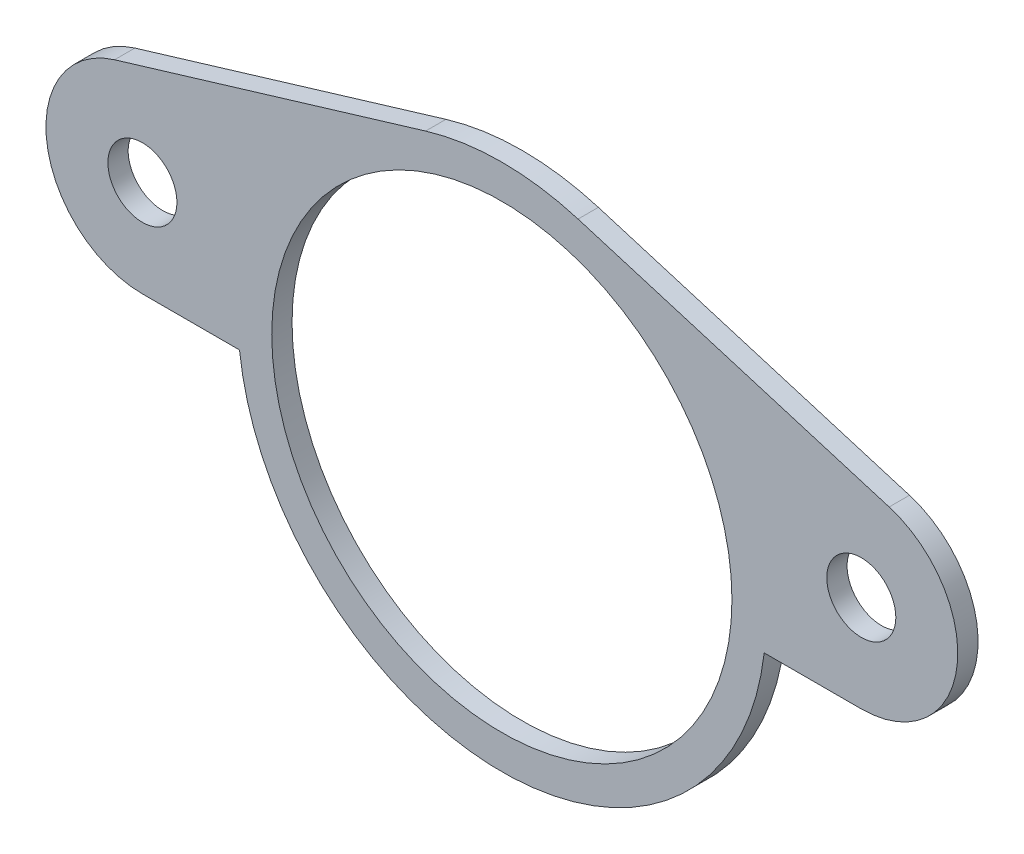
from build123d import *

# Parameters (mm, degrees)
SKETCH1_R           = 1.7
SKETCH1_R_2         = 11.33
BOSS_EXTRUDE1_DEPTH = 1


with BuildPart() as part:
    # Sketch1 → Boss-Extrude1 (new body)
    with BuildSketch(Plane.XY):
        with BuildLine():
            Line((12.916621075, -1.47), (17.698632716, -1.47))
            ThreePointArc((17.698632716, -1.47), (22.397794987, 2.586909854), (19.069977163, 7.827737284))
            Line((19.069977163, 7.827737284), (3.753153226, 12.446438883))
            ThreePointArc((3.753153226, 12.446438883), (0, 13), (-3.753153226, 12.446438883))
            Line((-3.753153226, 12.446438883), (-19.069977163, 7.827737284))
            ThreePointArc((-19.069977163, 7.827737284), (-22.397794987, 2.586909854), (-17.698632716, -1.47))
            Line((-17.698632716, -1.47), (-12.916621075, -1.47))
            ThreePointArc((-12.916621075, -1.47), (0, -13), (12.916621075, -1.47))
        make_face()
        with Locations((-17.698632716, 3.28)):
            Circle(SKETCH1_R, mode=Mode.SUBTRACT)
        with Locations((17.698632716, 3.28)):
            Circle(SKETCH1_R, mode=Mode.SUBTRACT)
        Circle(SKETCH1_R_2, mode=Mode.SUBTRACT)
    extrude(amount=BOSS_EXTRUDE1_DEPTH)


solid = part.part
